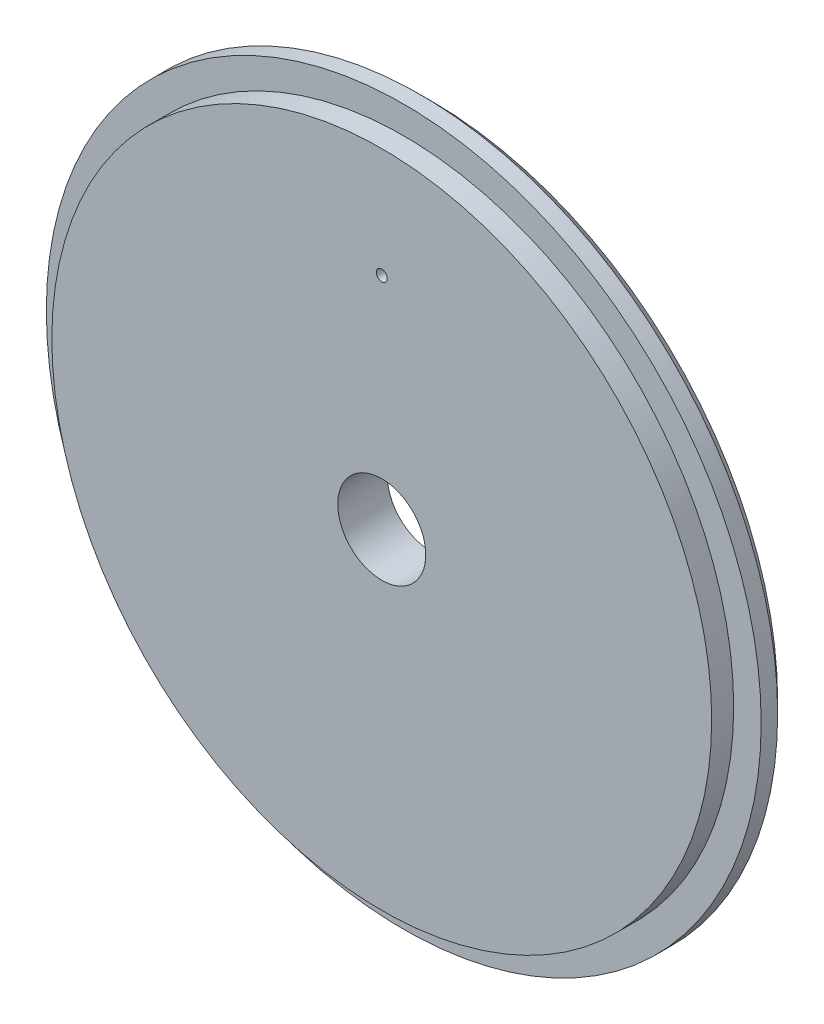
ISO-10303-21;
HEADER;
FILE_DESCRIPTION(('STEP AP214'),'2;1');
FILE_NAME('part.step','',(''),(''),'','','');
FILE_SCHEMA(('AUTOMOTIVE_DESIGN { 1 0 10303 214 1 1 1 1 }'));
ENDSEC;
DATA;
#1=APPLICATION_CONTEXT('core data for automotive mechanical design processes');
#2=APPLICATION_PROTOCOL_DEFINITION('international standard','automotive_design',2000,#1);
#3=PRODUCT_CONTEXT('',#1,'mechanical');
#4=PRODUCT('Part','Part','',(#3));
#5=PRODUCT_RELATED_PRODUCT_CATEGORY('part','',(#4));
#6=PRODUCT_DEFINITION_FORMATION('','',#4);
#7=PRODUCT_DEFINITION_CONTEXT('part definition',#1,'design');
#8=PRODUCT_DEFINITION('design','',#6,#7);
#9=PRODUCT_DEFINITION_SHAPE('','',#8);
#10=(LENGTH_UNIT() NAMED_UNIT(*) SI_UNIT(.MILLI.,.METRE.));
#11=(NAMED_UNIT(*) PLANE_ANGLE_UNIT() SI_UNIT($,.RADIAN.));
#12=(NAMED_UNIT(*) SI_UNIT($,.STERADIAN.) SOLID_ANGLE_UNIT());
#13=UNCERTAINTY_MEASURE_WITH_UNIT(LENGTH_MEASURE(1.E-05),#10,'distance_accuracy_value','');
#14=(GEOMETRIC_REPRESENTATION_CONTEXT(3) GLOBAL_UNCERTAINTY_ASSIGNED_CONTEXT((#13)) GLOBAL_UNIT_ASSIGNED_CONTEXT((#10,
#11,#12)) REPRESENTATION_CONTEXT('',''));
#15=CARTESIAN_POINT('',(0.,0.,0.));
#16=DIRECTION('',(0.,0.,1.));
#17=DIRECTION('',(1.,0.,0.));
#18=AXIS2_PLACEMENT_3D('',#15,#16,#17);
#19=CARTESIAN_POINT('',(0.,0.,2.5));
#20=DIRECTION('',(0.,0.,-1.));
#21=DIRECTION('',(-1.,0.,0.));
#22=AXIS2_PLACEMENT_3D('',#19,#20,#21);
#23=CYLINDRICAL_SURFACE('',#22,32.5);
#24=CARTESIAN_POINT('',(0.,0.,1.));
#25=DIRECTION('',(0.,0.,1.));
#26=DIRECTION('',(1.,0.,0.));
#27=AXIS2_PLACEMENT_3D('',#24,#25,#26);
#28=CIRCLE('',#27,32.5);
#29=CARTESIAN_POINT('',(32.5,0.,1.));
#30=VERTEX_POINT('',#29);
#31=EDGE_CURVE('E39',#30,#30,#28,.T.);
#32=ORIENTED_EDGE('',*,*,#31,.T.);
#33=EDGE_LOOP('',(#32));
#34=FACE_BOUND('',#33,.T.);
#35=CARTESIAN_POINT('',(0.,0.,2.5));
#36=DIRECTION('',(0.,0.,1.));
#37=DIRECTION('',(1.,0.,0.));
#38=AXIS2_PLACEMENT_3D('',#35,#36,#37);
#39=CIRCLE('',#38,32.5);
#40=CARTESIAN_POINT('',(32.5,0.,2.5));
#41=VERTEX_POINT('',#40);
#42=EDGE_CURVE('E43',#41,#41,#39,.T.);
#43=ORIENTED_EDGE('',*,*,#42,.F.);
#44=EDGE_LOOP('',(#43));
#45=FACE_BOUND('',#44,.T.);
#46=ADVANCED_FACE('F32',(#34,#45),#23,.T.);
#47=CARTESIAN_POINT('',(0.,0.,2.5));
#48=DIRECTION('',(0.,0.,1.));
#49=DIRECTION('',(1.,0.,0.));
#50=AXIS2_PLACEMENT_3D('',#47,#48,#49);
#51=PLANE('',#50);
#52=CARTESIAN_POINT('',(0.,0.,2.5));
#53=DIRECTION('',(0.,0.,1.));
#54=DIRECTION('',(1.,0.,0.));
#55=AXIS2_PLACEMENT_3D('',#52,#53,#54);
#56=CIRCLE('',#55,30.);
#57=CARTESIAN_POINT('',(30.,0.,2.5));
#58=VERTEX_POINT('',#57);
#59=EDGE_CURVE('E50',#58,#58,#56,.T.);
#60=ORIENTED_EDGE('',*,*,#59,.F.);
#61=EDGE_LOOP('',(#60));
#62=FACE_BOUND('',#61,.T.);
#63=ORIENTED_EDGE('',*,*,#42,.T.);
#64=EDGE_LOOP('',(#63));
#65=FACE_BOUND('',#64,.T.);
#66=ADVANCED_FACE('F74',(#62,#65),#51,.T.);
#67=CARTESIAN_POINT('',(0.,0.,0.));
#68=DIRECTION('',(0.,0.,1.));
#69=DIRECTION('',(1.,0.,0.));
#70=AXIS2_PLACEMENT_3D('',#67,#68,#69);
#71=PLANE('',#70);
#72=CARTESIAN_POINT('',(0.,0.,0.));
#73=DIRECTION('',(0.,0.,1.));
#74=DIRECTION('',(1.,0.,0.));
#75=AXIS2_PLACEMENT_3D('',#72,#73,#74);
#76=CIRCLE('',#75,31.5);
#77=CARTESIAN_POINT('',(31.5,0.,0.));
#78=VERTEX_POINT('',#77);
#79=EDGE_CURVE('E10',#78,#78,#76,.F.);
#80=ORIENTED_EDGE('',*,*,#79,.T.);
#81=EDGE_LOOP('',(#80));
#82=FACE_BOUND('',#81,.T.);
#83=CARTESIAN_POINT('',(0.,20.,0.));
#84=DIRECTION('',(0.,0.,-1.));
#85=DIRECTION('',(-1.,0.,0.));
#86=AXIS2_PLACEMENT_3D('',#83,#84,#85);
#87=CIRCLE('',#86,0.5);
#88=CARTESIAN_POINT('',(-0.5,20.,0.));
#89=VERTEX_POINT('',#88);
#90=EDGE_CURVE('E64',#89,#89,#87,.T.);
#91=ORIENTED_EDGE('',*,*,#90,.F.);
#92=EDGE_LOOP('',(#91));
#93=FACE_BOUND('',#92,.T.);
#94=CARTESIAN_POINT('',(0.,0.,0.));
#95=DIRECTION('',(0.,0.,-1.));
#96=DIRECTION('',(-1.,0.,0.));
#97=AXIS2_PLACEMENT_3D('',#94,#95,#96);
#98=CIRCLE('',#97,3.99999999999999);
#99=CARTESIAN_POINT('',(-3.99999999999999,0.,0.));
#100=VERTEX_POINT('',#99);
#101=EDGE_CURVE('E58',#100,#100,#98,.T.);
#102=ORIENTED_EDGE('',*,*,#101,.F.);
#103=EDGE_LOOP('',(#102));
#104=FACE_BOUND('',#103,.T.);
#105=ADVANCED_FACE('F70',(#82,#93,#104),#71,.F.);
#106=CARTESIAN_POINT('',(0.,0.,4.5));
#107=DIRECTION('',(0.,0.,-1.));
#108=DIRECTION('',(-1.,0.,0.));
#109=AXIS2_PLACEMENT_3D('',#106,#107,#108);
#110=CYLINDRICAL_SURFACE('',#109,30.);
#111=CARTESIAN_POINT('',(0.,0.,4.5));
#112=DIRECTION('',(0.,0.,1.));
#113=DIRECTION('',(1.,0.,0.));
#114=AXIS2_PLACEMENT_3D('',#111,#112,#113);
#115=CIRCLE('',#114,30.);
#116=CARTESIAN_POINT('',(30.,0.,4.5));
#117=VERTEX_POINT('',#116);
#118=EDGE_CURVE('E47',#117,#117,#115,.T.);
#119=ORIENTED_EDGE('',*,*,#118,.F.);
#120=EDGE_LOOP('',(#119));
#121=FACE_BOUND('',#120,.T.);
#122=ORIENTED_EDGE('',*,*,#59,.T.);
#123=EDGE_LOOP('',(#122));
#124=FACE_BOUND('',#123,.T.);
#125=ADVANCED_FACE('F73',(#121,#124),#110,.T.);
#126=CARTESIAN_POINT('',(0.,0.,4.5));
#127=DIRECTION('',(0.,0.,1.));
#128=DIRECTION('',(1.,0.,0.));
#129=AXIS2_PLACEMENT_3D('',#126,#127,#128);
#130=PLANE('',#129);
#131=CARTESIAN_POINT('',(0.,20.,4.5));
#132=DIRECTION('',(0.,0.,-1.));
#133=DIRECTION('',(-1.,0.,0.));
#134=AXIS2_PLACEMENT_3D('',#131,#132,#133);
#135=CIRCLE('',#134,0.499999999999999);
#136=CARTESIAN_POINT('',(-0.499999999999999,20.,4.5));
#137=VERTEX_POINT('',#136);
#138=EDGE_CURVE('E61',#137,#137,#135,.T.);
#139=ORIENTED_EDGE('',*,*,#138,.T.);
#140=EDGE_LOOP('',(#139));
#141=FACE_BOUND('',#140,.T.);
#142=CARTESIAN_POINT('',(0.,0.,4.5));
#143=DIRECTION('',(0.,0.,-1.));
#144=DIRECTION('',(-1.,0.,0.));
#145=AXIS2_PLACEMENT_3D('',#142,#143,#144);
#146=CIRCLE('',#145,4.);
#147=CARTESIAN_POINT('',(-4.,0.,4.5));
#148=VERTEX_POINT('',#147);
#149=EDGE_CURVE('E53',#148,#148,#146,.T.);
#150=ORIENTED_EDGE('',*,*,#149,.T.);
#151=EDGE_LOOP('',(#150));
#152=FACE_BOUND('',#151,.T.);
#153=ORIENTED_EDGE('',*,*,#118,.T.);
#154=EDGE_LOOP('',(#153));
#155=FACE_BOUND('',#154,.T.);
#156=ADVANCED_FACE('F80',(#141,#152,#155),#130,.T.);
#157=CARTESIAN_POINT('',(0.,0.,0.));
#158=DIRECTION('',(0.,0.,-1.));
#159=DIRECTION('',(-1.,0.,0.));
#160=AXIS2_PLACEMENT_3D('',#157,#158,#159);
#161=CYLINDRICAL_SURFACE('',#160,3.99999999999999);
#162=ORIENTED_EDGE('',*,*,#149,.F.);
#163=EDGE_LOOP('',(#162));
#164=FACE_BOUND('',#163,.T.);
#165=ORIENTED_EDGE('',*,*,#101,.T.);
#166=EDGE_LOOP('',(#165));
#167=FACE_BOUND('',#166,.T.);
#168=ADVANCED_FACE('F78',(#164,#167),#161,.F.);
#169=CARTESIAN_POINT('',(0.,20.,0.));
#170=DIRECTION('',(0.,0.,-1.));
#171=DIRECTION('',(-1.,0.,0.));
#172=AXIS2_PLACEMENT_3D('',#169,#170,#171);
#173=CYLINDRICAL_SURFACE('',#172,0.5);
#174=ORIENTED_EDGE('',*,*,#138,.F.);
#175=EDGE_LOOP('',(#174));
#176=FACE_BOUND('',#175,.T.);
#177=ORIENTED_EDGE('',*,*,#90,.T.);
#178=EDGE_LOOP('',(#177));
#179=FACE_BOUND('',#178,.T.);
#180=ADVANCED_FACE('F68',(#176,#179),#173,.F.);
#181=CARTESIAN_POINT('',(0.,0.,1.));
#182=DIRECTION('',(0.,0.,1.));
#183=DIRECTION('',(1.,0.,0.));
#184=AXIS2_PLACEMENT_3D('',#181,#182,#183);
#185=CONICAL_SURFACE('',#184,32.5,0.785398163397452);
#186=ORIENTED_EDGE('',*,*,#79,.F.);
#187=EDGE_LOOP('',(#186));
#188=FACE_BOUND('',#187,.T.);
#189=ORIENTED_EDGE('',*,*,#31,.F.);
#190=EDGE_LOOP('',(#189));
#191=FACE_BOUND('',#190,.T.);
#192=ADVANCED_FACE('F34',(#188,#191),#185,.T.);
#193=CLOSED_SHELL('',(#46,#66,#105,#125,#156,#168,#180,#192));
#194=MANIFOLD_SOLID_BREP('B2',#193);
#195=ADVANCED_BREP_SHAPE_REPRESENTATION('',(#18,#194),#14);
#196=SHAPE_DEFINITION_REPRESENTATION(#9,#195);
ENDSEC;
END-ISO-10303-21;
